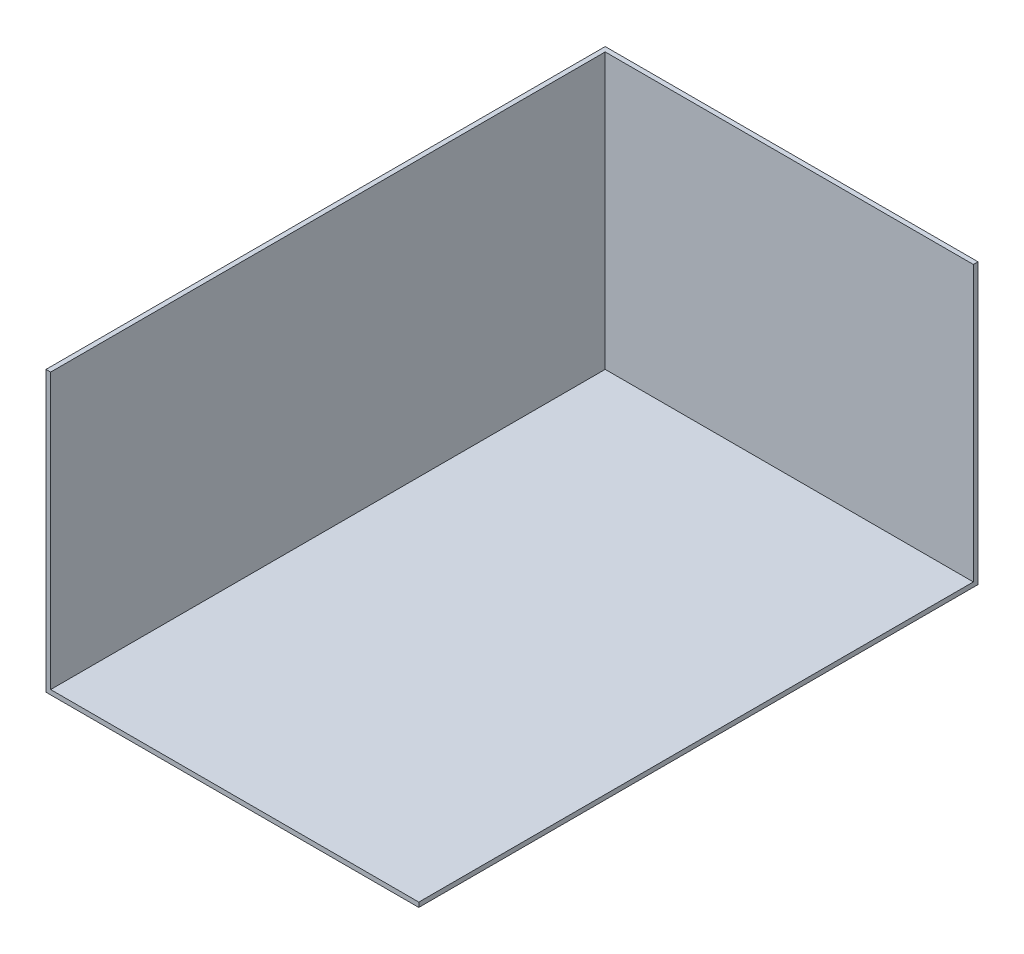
ISO-10303-21;
HEADER;
FILE_DESCRIPTION(('STEP AP214'),'2;1');
FILE_NAME('part.step','',(''),(''),'','','');
FILE_SCHEMA(('AUTOMOTIVE_DESIGN { 1 0 10303 214 1 1 1 1 }'));
ENDSEC;
DATA;
#1=APPLICATION_CONTEXT('core data for automotive mechanical design processes');
#2=APPLICATION_PROTOCOL_DEFINITION('international standard','automotive_design',2000,#1);
#3=PRODUCT_CONTEXT('',#1,'mechanical');
#4=PRODUCT('Part','Part','',(#3));
#5=PRODUCT_RELATED_PRODUCT_CATEGORY('part','',(#4));
#6=PRODUCT_DEFINITION_FORMATION('','',#4);
#7=PRODUCT_DEFINITION_CONTEXT('part definition',#1,'design');
#8=PRODUCT_DEFINITION('design','',#6,#7);
#9=PRODUCT_DEFINITION_SHAPE('','',#8);
#10=(LENGTH_UNIT() NAMED_UNIT(*) SI_UNIT(.MILLI.,.METRE.));
#11=(NAMED_UNIT(*) PLANE_ANGLE_UNIT() SI_UNIT($,.RADIAN.));
#12=(NAMED_UNIT(*) SI_UNIT($,.STERADIAN.) SOLID_ANGLE_UNIT());
#13=UNCERTAINTY_MEASURE_WITH_UNIT(LENGTH_MEASURE(1.E-05),#10,'distance_accuracy_value','');
#14=(GEOMETRIC_REPRESENTATION_CONTEXT(3) GLOBAL_UNCERTAINTY_ASSIGNED_CONTEXT((#13)) GLOBAL_UNIT_ASSIGNED_CONTEXT((#10,
#11,#12)) REPRESENTATION_CONTEXT('',''));
#15=CARTESIAN_POINT('',(0.,0.,0.));
#16=DIRECTION('',(0.,0.,1.));
#17=DIRECTION('',(1.,0.,0.));
#18=AXIS2_PLACEMENT_3D('',#15,#16,#17);
#19=CARTESIAN_POINT('',(254.,381.,381.));
#20=DIRECTION('',(0.,0.,-1.));
#21=DIRECTION('',(-1.,0.,0.));
#22=AXIS2_PLACEMENT_3D('',#19,#20,#21);
#23=PLANE('',#22);
#24=DIRECTION('',(1.,0.,0.));
#25=VECTOR('',#24,1.);
#26=CARTESIAN_POINT('',(254.,6.35000000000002,381.));
#27=LINE('',#26,#25);
#28=CARTESIAN_POINT('',(-247.65,6.35,381.));
#29=VERTEX_POINT('',#28);
#30=CARTESIAN_POINT('',(254.,6.35000000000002,381.));
#31=VERTEX_POINT('',#30);
#32=EDGE_CURVE('E120',#29,#31,#27,.T.);
#33=ORIENTED_EDGE('',*,*,#32,.F.);
#34=DIRECTION('',(0.,-1.,0.));
#35=VECTOR('',#34,1.);
#36=CARTESIAN_POINT('',(-247.65,381.,381.));
#37=LINE('',#36,#35);
#38=CARTESIAN_POINT('',(-247.65,381.,381.));
#39=VERTEX_POINT('',#38);
#40=EDGE_CURVE('E119',#39,#29,#37,.T.);
#41=ORIENTED_EDGE('',*,*,#40,.F.);
#42=DIRECTION('',(1.,0.,0.));
#43=VECTOR('',#42,1.);
#44=CARTESIAN_POINT('',(254.,381.,381.));
#45=LINE('',#44,#43);
#46=CARTESIAN_POINT('',(-254.,381.,381.));
#47=VERTEX_POINT('',#46);
#48=EDGE_CURVE('E82',#47,#39,#45,.T.);
#49=ORIENTED_EDGE('',*,*,#48,.F.);
#50=DIRECTION('',(0.,-1.,0.));
#51=VECTOR('',#50,1.);
#52=CARTESIAN_POINT('',(-254.,381.,381.));
#53=LINE('',#52,#51);
#54=CARTESIAN_POINT('',(-254.,0.,381.));
#55=VERTEX_POINT('',#54);
#56=EDGE_CURVE('E11',#47,#55,#53,.T.);
#57=ORIENTED_EDGE('',*,*,#56,.T.);
#58=DIRECTION('',(1.,0.,0.));
#59=VECTOR('',#58,1.);
#60=CARTESIAN_POINT('',(254.,0.,381.));
#61=LINE('',#60,#59);
#62=CARTESIAN_POINT('',(254.,0.,381.));
#63=VERTEX_POINT('',#62);
#64=EDGE_CURVE('E139',#55,#63,#61,.T.);
#65=ORIENTED_EDGE('',*,*,#64,.T.);
#66=DIRECTION('',(0.,-1.,0.));
#67=VECTOR('',#66,1.);
#68=CARTESIAN_POINT('',(254.,381.,381.));
#69=LINE('',#68,#67);
#70=EDGE_CURVE('E40',#31,#63,#69,.T.);
#71=ORIENTED_EDGE('',*,*,#70,.F.);
#72=EDGE_LOOP('',(#33,#41,#49,#57,#65,#71));
#73=FACE_BOUND('',#72,.T.);
#74=ADVANCED_FACE('F32',(#73),#23,.F.);
#75=CARTESIAN_POINT('',(254.,381.,381.));
#76=DIRECTION('',(-1.,0.,0.));
#77=DIRECTION('',(0.,0.,1.));
#78=AXIS2_PLACEMENT_3D('',#75,#76,#77);
#79=PLANE('',#78);
#80=DIRECTION('',(0.,0.,-1.));
#81=VECTOR('',#80,1.);
#82=CARTESIAN_POINT('',(254.,6.35000000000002,381.));
#83=LINE('',#82,#81);
#84=CARTESIAN_POINT('',(254.,6.35,-374.65));
#85=VERTEX_POINT('',#84);
#86=EDGE_CURVE('E108',#31,#85,#83,.T.);
#87=ORIENTED_EDGE('',*,*,#86,.F.);
#88=ORIENTED_EDGE('',*,*,#70,.T.);
#89=DIRECTION('',(0.,0.,-1.));
#90=VECTOR('',#89,1.);
#91=CARTESIAN_POINT('',(254.,0.,381.));
#92=LINE('',#91,#90);
#93=CARTESIAN_POINT('',(254.,0.,-381.));
#94=VERTEX_POINT('',#93);
#95=EDGE_CURVE('E142',#63,#94,#92,.T.);
#96=ORIENTED_EDGE('',*,*,#95,.T.);
#97=DIRECTION('',(0.,-1.,0.));
#98=VECTOR('',#97,1.);
#99=CARTESIAN_POINT('',(254.,381.,-381.));
#100=LINE('',#99,#98);
#101=CARTESIAN_POINT('',(254.,381.,-381.));
#102=VERTEX_POINT('',#101);
#103=EDGE_CURVE('E146',#102,#94,#100,.T.);
#104=ORIENTED_EDGE('',*,*,#103,.F.);
#105=DIRECTION('',(0.,0.,-1.));
#106=VECTOR('',#105,1.);
#107=CARTESIAN_POINT('',(254.,381.,381.));
#108=LINE('',#107,#106);
#109=CARTESIAN_POINT('',(254.,381.,-374.65));
#110=VERTEX_POINT('',#109);
#111=EDGE_CURVE('E133',#110,#102,#108,.T.);
#112=ORIENTED_EDGE('',*,*,#111,.F.);
#113=DIRECTION('',(0.,-1.,0.));
#114=VECTOR('',#113,1.);
#115=CARTESIAN_POINT('',(254.,381.,-374.65));
#116=LINE('',#115,#114);
#117=EDGE_CURVE('E47',#110,#85,#116,.T.);
#118=ORIENTED_EDGE('',*,*,#117,.T.);
#119=EDGE_LOOP('',(#87,#88,#96,#104,#112,#118));
#120=FACE_BOUND('',#119,.T.);
#121=ADVANCED_FACE('F149',(#120),#79,.F.);
#122=CARTESIAN_POINT('',(-254.,381.,381.));
#123=DIRECTION('',(1.,0.,0.));
#124=DIRECTION('',(0.,0.,-1.));
#125=AXIS2_PLACEMENT_3D('',#122,#123,#124);
#126=PLANE('',#125);
#127=DIRECTION('',(0.,0.,1.));
#128=VECTOR('',#127,1.);
#129=CARTESIAN_POINT('',(-254.,0.,381.));
#130=LINE('',#129,#128);
#131=CARTESIAN_POINT('',(-254.,0.,-381.));
#132=VERTEX_POINT('',#131);
#133=EDGE_CURVE('E124',#132,#55,#130,.T.);
#134=ORIENTED_EDGE('',*,*,#133,.T.);
#135=ORIENTED_EDGE('',*,*,#56,.F.);
#136=DIRECTION('',(0.,0.,1.));
#137=VECTOR('',#136,1.);
#138=CARTESIAN_POINT('',(-254.,381.,381.));
#139=LINE('',#138,#137);
#140=CARTESIAN_POINT('',(-254.,381.,-381.));
#141=VERTEX_POINT('',#140);
#142=EDGE_CURVE('E130',#141,#47,#139,.T.);
#143=ORIENTED_EDGE('',*,*,#142,.F.);
#144=DIRECTION('',(0.,-1.,0.));
#145=VECTOR('',#144,1.);
#146=CARTESIAN_POINT('',(-254.,381.,-381.));
#147=LINE('',#146,#145);
#148=EDGE_CURVE('E136',#141,#132,#147,.T.);
#149=ORIENTED_EDGE('',*,*,#148,.T.);
#150=EDGE_LOOP('',(#134,#135,#143,#149));
#151=FACE_BOUND('',#150,.T.);
#152=ADVANCED_FACE('F34',(#151),#126,.F.);
#153=CARTESIAN_POINT('',(254.,381.,-381.));
#154=DIRECTION('',(0.,0.,1.));
#155=DIRECTION('',(1.,0.,0.));
#156=AXIS2_PLACEMENT_3D('',#153,#154,#155);
#157=PLANE('',#156);
#158=DIRECTION('',(-1.,0.,0.));
#159=VECTOR('',#158,1.);
#160=CARTESIAN_POINT('',(254.,0.,-381.));
#161=LINE('',#160,#159);
#162=EDGE_CURVE('E76',#94,#132,#161,.T.);
#163=ORIENTED_EDGE('',*,*,#162,.T.);
#164=ORIENTED_EDGE('',*,*,#148,.F.);
#165=DIRECTION('',(-1.,0.,0.));
#166=VECTOR('',#165,1.);
#167=CARTESIAN_POINT('',(254.,381.,-381.));
#168=LINE('',#167,#166);
#169=EDGE_CURVE('E56',#102,#141,#168,.T.);
#170=ORIENTED_EDGE('',*,*,#169,.F.);
#171=ORIENTED_EDGE('',*,*,#103,.T.);
#172=EDGE_LOOP('',(#163,#164,#170,#171));
#173=FACE_BOUND('',#172,.T.);
#174=ADVANCED_FACE('F158',(#173),#157,.F.);
#175=CARTESIAN_POINT('',(-254.,381.,-381.));
#176=DIRECTION('',(0.,1.,0.));
#177=DIRECTION('',(0.,0.,1.));
#178=AXIS2_PLACEMENT_3D('',#175,#176,#177);
#179=PLANE('',#178);
#180=DIRECTION('',(0.,0.,1.));
#181=VECTOR('',#180,1.);
#182=CARTESIAN_POINT('',(-247.65,381.,381.));
#183=LINE('',#182,#181);
#184=CARTESIAN_POINT('',(-247.65,381.,-374.65));
#185=VERTEX_POINT('',#184);
#186=EDGE_CURVE('E109',#185,#39,#183,.T.);
#187=ORIENTED_EDGE('',*,*,#186,.F.);
#188=DIRECTION('',(-1.,0.,0.));
#189=VECTOR('',#188,1.);
#190=CARTESIAN_POINT('',(254.,381.,-374.65));
#191=LINE('',#190,#189);
#192=EDGE_CURVE('E114',#110,#185,#191,.T.);
#193=ORIENTED_EDGE('',*,*,#192,.F.);
#194=ORIENTED_EDGE('',*,*,#111,.T.);
#195=ORIENTED_EDGE('',*,*,#169,.T.);
#196=ORIENTED_EDGE('',*,*,#142,.T.);
#197=ORIENTED_EDGE('',*,*,#48,.T.);
#198=EDGE_LOOP('',(#187,#193,#194,#195,#196,#197));
#199=FACE_BOUND('',#198,.T.);
#200=ADVANCED_FACE('F160',(#199),#179,.T.);
#201=CARTESIAN_POINT('',(-254.,0.,-381.));
#202=DIRECTION('',(0.,1.,0.));
#203=DIRECTION('',(0.,0.,1.));
#204=AXIS2_PLACEMENT_3D('',#201,#202,#203);
#205=PLANE('',#204);
#206=ORIENTED_EDGE('',*,*,#133,.F.);
#207=ORIENTED_EDGE('',*,*,#162,.F.);
#208=ORIENTED_EDGE('',*,*,#95,.F.);
#209=ORIENTED_EDGE('',*,*,#64,.F.);
#210=EDGE_LOOP('',(#206,#207,#208,#209));
#211=FACE_BOUND('',#210,.T.);
#212=ADVANCED_FACE('F155',(#211),#205,.F.);
#213=CARTESIAN_POINT('',(-247.65,381.,381.));
#214=DIRECTION('',(1.,0.,0.));
#215=DIRECTION('',(0.,0.,-1.));
#216=AXIS2_PLACEMENT_3D('',#213,#214,#215);
#217=PLANE('',#216);
#218=DIRECTION('',(0.,0.,1.));
#219=VECTOR('',#218,1.);
#220=CARTESIAN_POINT('',(-247.65,6.35000000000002,381.));
#221=LINE('',#220,#219);
#222=CARTESIAN_POINT('',(-247.65,6.35,-374.65));
#223=VERTEX_POINT('',#222);
#224=EDGE_CURVE('E105',#223,#29,#221,.T.);
#225=ORIENTED_EDGE('',*,*,#224,.F.);
#226=DIRECTION('',(0.,-1.,0.));
#227=VECTOR('',#226,1.);
#228=CARTESIAN_POINT('',(-247.65,381.,-374.65));
#229=LINE('',#228,#227);
#230=EDGE_CURVE('E112',#185,#223,#229,.T.);
#231=ORIENTED_EDGE('',*,*,#230,.F.);
#232=ORIENTED_EDGE('',*,*,#186,.T.);
#233=ORIENTED_EDGE('',*,*,#40,.T.);
#234=EDGE_LOOP('',(#225,#231,#232,#233));
#235=FACE_BOUND('',#234,.T.);
#236=ADVANCED_FACE('F118',(#235),#217,.T.);
#237=CARTESIAN_POINT('',(254.,381.,-374.65));
#238=DIRECTION('',(0.,0.,1.));
#239=DIRECTION('',(1.,0.,0.));
#240=AXIS2_PLACEMENT_3D('',#237,#238,#239);
#241=PLANE('',#240);
#242=DIRECTION('',(-1.,0.,0.));
#243=VECTOR('',#242,1.);
#244=CARTESIAN_POINT('',(254.,6.35000000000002,-374.65));
#245=LINE('',#244,#243);
#246=EDGE_CURVE('E101',#85,#223,#245,.T.);
#247=ORIENTED_EDGE('',*,*,#246,.F.);
#248=ORIENTED_EDGE('',*,*,#117,.F.);
#249=ORIENTED_EDGE('',*,*,#192,.T.);
#250=ORIENTED_EDGE('',*,*,#230,.T.);
#251=EDGE_LOOP('',(#247,#248,#249,#250));
#252=FACE_BOUND('',#251,.T.);
#253=ADVANCED_FACE('F113',(#252),#241,.T.);
#254=CARTESIAN_POINT('',(-254.,6.35,-381.));
#255=DIRECTION('',(0.,1.,0.));
#256=DIRECTION('',(0.,0.,1.));
#257=AXIS2_PLACEMENT_3D('',#254,#255,#256);
#258=PLANE('',#257);
#259=ORIENTED_EDGE('',*,*,#224,.T.);
#260=ORIENTED_EDGE('',*,*,#32,.T.);
#261=ORIENTED_EDGE('',*,*,#86,.T.);
#262=ORIENTED_EDGE('',*,*,#246,.T.);
#263=EDGE_LOOP('',(#259,#260,#261,#262));
#264=FACE_BOUND('',#263,.T.);
#265=ADVANCED_FACE('F103',(#264),#258,.T.);
#266=CLOSED_SHELL('',(#74,#121,#152,#174,#200,#212,#236,#253,#265));
#267=MANIFOLD_SOLID_BREP('B2',#266);
#268=ADVANCED_BREP_SHAPE_REPRESENTATION('',(#18,#267),#14);
#269=SHAPE_DEFINITION_REPRESENTATION(#9,#268);
ENDSEC;
END-ISO-10303-21;
